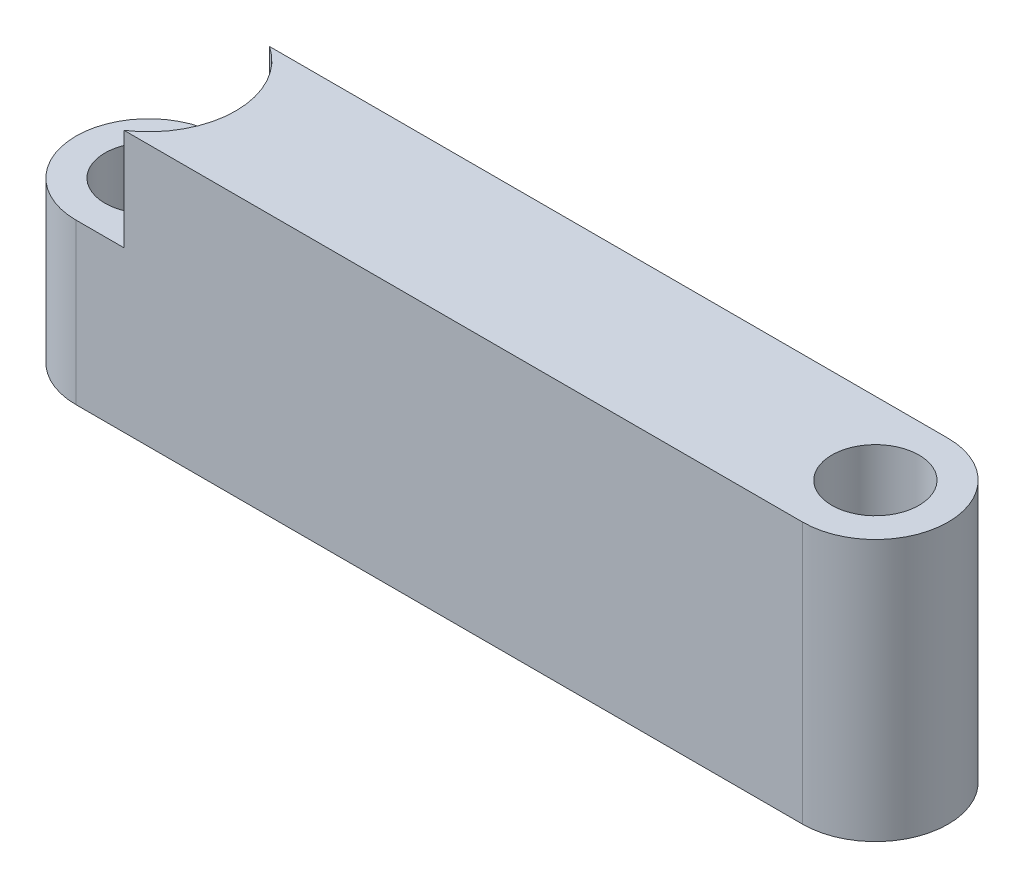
from build123d import *

# Parameters (mm, degrees)
SKETCH1_R           = 2.5
SKETCH1_R_2         = 1.5
BOSS_EXTRUDE2_DEPTH = 9
SKETCH3_R           = 3
CUT_EXTRUDE1_DEPTH  = 3.5


with BuildPart() as part:
    # Sketch1 → Boss-Extrude2 (new body)
    # profile 1 of 3: a face of its own
    with BuildSketch(Plane(origin=(0, 0, 0), x_dir=(1, 0, 0), z_dir=(0, 1, 0))):
        with Locations((-10.982789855, 0)):
            Circle(SKETCH1_R)
        with Locations(Location((-10.982789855, 0, 0), (0, 0, 270))):
            Circle(SKETCH1_R_2, mode=Mode.SUBTRACT)
    # profile 2 of 3: a face of its own
    with BuildSketch(Plane(origin=(0, 0, 0), x_dir=(1, 0, 0), z_dir=(0, 1, 0))):
        with BuildLine():
            Line((14.017210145, 2.5), (-10.982789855, 2.5))
            ThreePointArc((-10.982789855, 2.5), (-9.215022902, 1.767766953), (-8.482789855, 0))
            ThreePointArc((-8.482789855, 0), (-9.215022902, -1.767766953), (-10.982789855, -2.5))
            Line((-10.982789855, -2.5), (14.017210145, -2.5))
            ThreePointArc((14.017210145, -2.5), (11.517210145, 0), (14.017210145, 2.5))
        make_face()
    # profile 3 of 3: a face of its own
    with BuildSketch(Plane(origin=(0, 0, 0), x_dir=(1, 0, 0), z_dir=(0, 1, 0))):
        with Locations((14.017210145, 0)):
            Circle(SKETCH1_R)
        with Locations(Location((14.017210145, 0, 0), (0, 0, 270))):
            Circle(SKETCH1_R_2, mode=Mode.SUBTRACT)
    extrude(amount=BOSS_EXTRUDE2_DEPTH)

    # Sketch3 → Cut-Extrude1 (cut)
    with BuildSketch(Plane(origin=(0, 9, 0), x_dir=(1, 0, 0), z_dir=(0, 1, 0))):
        with Locations((-10.982789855, 0)):
            Circle(SKETCH3_R)
    extrude(amount=-CUT_EXTRUDE1_DEPTH, mode=Mode.SUBTRACT)


solid = part.part
